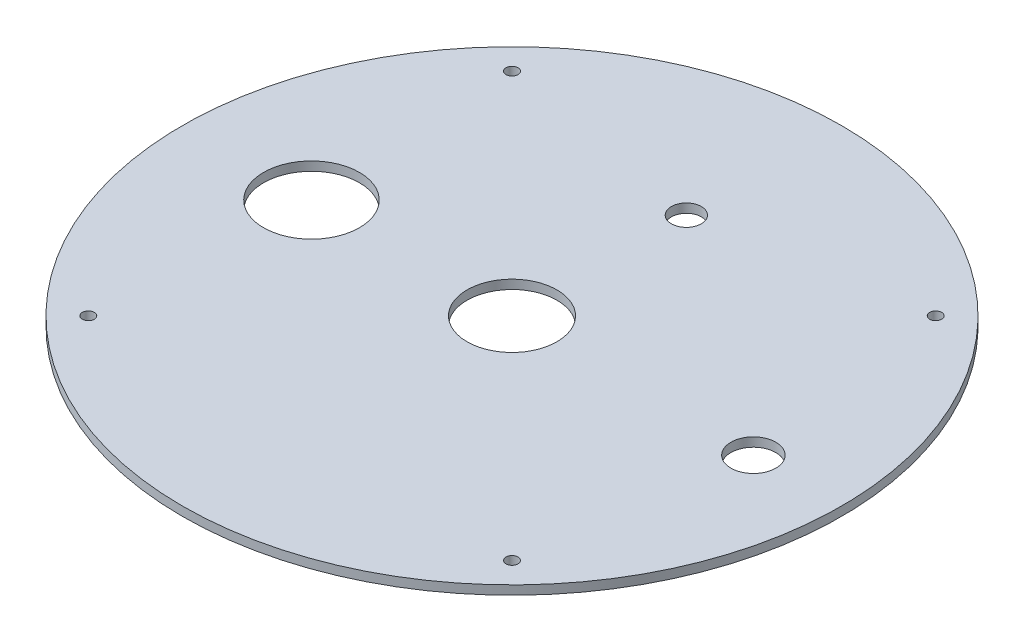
ISO-10303-21;
HEADER;
FILE_DESCRIPTION(('STEP AP214'),'2;1');
FILE_NAME('part.step','',(''),(''),'','','');
FILE_SCHEMA(('AUTOMOTIVE_DESIGN { 1 0 10303 214 1 1 1 1 }'));
ENDSEC;
DATA;
#1=APPLICATION_CONTEXT('core data for automotive mechanical design processes');
#2=APPLICATION_PROTOCOL_DEFINITION('international standard','automotive_design',2000,#1);
#3=PRODUCT_CONTEXT('',#1,'mechanical');
#4=PRODUCT('Part','Part','',(#3));
#5=PRODUCT_RELATED_PRODUCT_CATEGORY('part','',(#4));
#6=PRODUCT_DEFINITION_FORMATION('','',#4);
#7=PRODUCT_DEFINITION_CONTEXT('part definition',#1,'design');
#8=PRODUCT_DEFINITION('design','',#6,#7);
#9=PRODUCT_DEFINITION_SHAPE('','',#8);
#10=(LENGTH_UNIT() NAMED_UNIT(*) SI_UNIT(.MILLI.,.METRE.));
#11=(NAMED_UNIT(*) PLANE_ANGLE_UNIT() SI_UNIT($,.RADIAN.));
#12=(NAMED_UNIT(*) SI_UNIT($,.STERADIAN.) SOLID_ANGLE_UNIT());
#13=UNCERTAINTY_MEASURE_WITH_UNIT(LENGTH_MEASURE(1.E-05),#10,'distance_accuracy_value','');
#14=(GEOMETRIC_REPRESENTATION_CONTEXT(3) GLOBAL_UNCERTAINTY_ASSIGNED_CONTEXT((#13)) GLOBAL_UNIT_ASSIGNED_CONTEXT((#10,
#11,#12)) REPRESENTATION_CONTEXT('',''));
#15=CARTESIAN_POINT('',(0.,0.,0.));
#16=DIRECTION('',(0.,0.,1.));
#17=DIRECTION('',(1.,0.,0.));
#18=AXIS2_PLACEMENT_3D('',#15,#16,#17);
#19=CARTESIAN_POINT('',(0.,1.5,0.));
#20=DIRECTION('',(0.,-1.,0.));
#21=DIRECTION('',(0.,0.,-1.));
#22=AXIS2_PLACEMENT_3D('',#19,#20,#21);
#23=CYLINDRICAL_SURFACE('',#22,55.);
#24=CARTESIAN_POINT('',(0.,1.5,0.));
#25=DIRECTION('',(0.,1.,0.));
#26=DIRECTION('',(0.,0.,1.));
#27=AXIS2_PLACEMENT_3D('',#24,#25,#26);
#28=CIRCLE('',#27,55.);
#29=CARTESIAN_POINT('',(0.,1.5,55.));
#30=VERTEX_POINT('',#29);
#31=EDGE_CURVE('E10',#30,#30,#28,.T.);
#32=ORIENTED_EDGE('',*,*,#31,.F.);
#33=EDGE_LOOP('',(#32));
#34=FACE_BOUND('',#33,.T.);
#35=CARTESIAN_POINT('',(0.,0.,0.));
#36=DIRECTION('',(0.,1.,0.));
#37=DIRECTION('',(0.,0.,1.));
#38=AXIS2_PLACEMENT_3D('',#35,#36,#37);
#39=CIRCLE('',#38,55.);
#40=CARTESIAN_POINT('',(0.,0.,55.));
#41=VERTEX_POINT('',#40);
#42=EDGE_CURVE('E36',#41,#41,#39,.T.);
#43=ORIENTED_EDGE('',*,*,#42,.T.);
#44=EDGE_LOOP('',(#43));
#45=FACE_BOUND('',#44,.T.);
#46=ADVANCED_FACE('F33',(#34,#45),#23,.T.);
#47=CARTESIAN_POINT('',(0.,1.5,0.));
#48=DIRECTION('',(0.,1.,0.));
#49=DIRECTION('',(0.,0.,1.));
#50=AXIS2_PLACEMENT_3D('',#47,#48,#49);
#51=PLANE('',#50);
#52=CARTESIAN_POINT('',(40.286094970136,1.5,0.));
#53=DIRECTION('',(0.,-1.,0.));
#54=DIRECTION('',(0.,0.,-1.));
#55=AXIS2_PLACEMENT_3D('',#52,#53,#54);
#56=CIRCLE('',#55,3.75);
#57=CARTESIAN_POINT('',(40.286094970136,1.5,-3.75));
#58=VERTEX_POINT('',#57);
#59=EDGE_CURVE('E84',#58,#58,#56,.T.);
#60=ORIENTED_EDGE('',*,*,#59,.T.);
#61=EDGE_LOOP('',(#60));
#62=FACE_BOUND('',#61,.T.);
#63=CARTESIAN_POINT('',(0.,1.5,-29.0955130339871));
#64=DIRECTION('',(0.,-1.,0.));
#65=DIRECTION('',(0.,0.,-1.));
#66=AXIS2_PLACEMENT_3D('',#63,#64,#65);
#67=CIRCLE('',#66,2.5);
#68=CARTESIAN_POINT('',(0.,1.5,-31.5955130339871));
#69=VERTEX_POINT('',#68);
#70=EDGE_CURVE('E78',#69,#69,#67,.T.);
#71=ORIENTED_EDGE('',*,*,#70,.T.);
#72=EDGE_LOOP('',(#71));
#73=FACE_BOUND('',#72,.T.);
#74=CARTESIAN_POINT('',(-33.462326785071,1.5,0.));
#75=DIRECTION('',(0.,-1.,0.));
#76=DIRECTION('',(0.,0.,-1.));
#77=AXIS2_PLACEMENT_3D('',#74,#75,#76);
#78=CIRCLE('',#77,8.);
#79=CARTESIAN_POINT('',(-33.462326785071,1.5,-8.));
#80=VERTEX_POINT('',#79);
#81=EDGE_CURVE('E74',#80,#80,#78,.T.);
#82=ORIENTED_EDGE('',*,*,#81,.T.);
#83=EDGE_LOOP('',(#82));
#84=FACE_BOUND('',#83,.T.);
#85=CARTESIAN_POINT('',(0.,1.5,0.));
#86=DIRECTION('',(0.,1.,0.));
#87=DIRECTION('',(0.,0.,1.));
#88=AXIS2_PLACEMENT_3D('',#85,#86,#87);
#89=CIRCLE('',#88,7.5);
#90=CARTESIAN_POINT('',(0.,1.5,7.50000000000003));
#91=VERTEX_POINT('',#90);
#92=EDGE_CURVE('E71',#91,#91,#89,.T.);
#93=ORIENTED_EDGE('',*,*,#92,.F.);
#94=EDGE_LOOP('',(#93));
#95=FACE_BOUND('',#94,.T.);
#96=CARTESIAN_POINT('',(35.3553390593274,1.5,-35.3553390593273));
#97=DIRECTION('',(0.,1.,0.));
#98=DIRECTION('',(0.,0.,1.));
#99=AXIS2_PLACEMENT_3D('',#96,#97,#98);
#100=CIRCLE('',#99,0.999999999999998);
#101=CARTESIAN_POINT('',(35.3553390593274,1.5,-34.3553390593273));
#102=VERTEX_POINT('',#101);
#103=EDGE_CURVE('E65',#102,#102,#100,.T.);
#104=ORIENTED_EDGE('',*,*,#103,.F.);
#105=EDGE_LOOP('',(#104));
#106=FACE_BOUND('',#105,.T.);
#107=CARTESIAN_POINT('',(35.3553390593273,1.5,35.3553390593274));
#108=DIRECTION('',(0.,1.,0.));
#109=DIRECTION('',(0.,0.,1.));
#110=AXIS2_PLACEMENT_3D('',#107,#108,#109);
#111=CIRCLE('',#110,0.999999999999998);
#112=CARTESIAN_POINT('',(35.3553390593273,1.5,36.3553390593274));
#113=VERTEX_POINT('',#112);
#114=EDGE_CURVE('E59',#113,#113,#111,.T.);
#115=ORIENTED_EDGE('',*,*,#114,.F.);
#116=EDGE_LOOP('',(#115));
#117=FACE_BOUND('',#116,.T.);
#118=CARTESIAN_POINT('',(-35.3553390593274,1.5,35.3553390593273));
#119=DIRECTION('',(0.,1.,0.));
#120=DIRECTION('',(0.,0.,1.));
#121=AXIS2_PLACEMENT_3D('',#118,#119,#120);
#122=CIRCLE('',#121,0.999999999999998);
#123=CARTESIAN_POINT('',(-35.3553390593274,1.5,36.3553390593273));
#124=VERTEX_POINT('',#123);
#125=EDGE_CURVE('E53',#124,#124,#122,.T.);
#126=ORIENTED_EDGE('',*,*,#125,.F.);
#127=EDGE_LOOP('',(#126));
#128=FACE_BOUND('',#127,.T.);
#129=CARTESIAN_POINT('',(-35.3553390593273,1.5,-35.3553390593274));
#130=DIRECTION('',(0.,1.,0.));
#131=DIRECTION('',(0.,0.,1.));
#132=AXIS2_PLACEMENT_3D('',#129,#130,#131);
#133=CIRCLE('',#132,0.999999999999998);
#134=CARTESIAN_POINT('',(-35.3553390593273,1.5,-34.3553390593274));
#135=VERTEX_POINT('',#134);
#136=EDGE_CURVE('E47',#135,#135,#133,.T.);
#137=ORIENTED_EDGE('',*,*,#136,.F.);
#138=EDGE_LOOP('',(#137));
#139=FACE_BOUND('',#138,.T.);
#140=ORIENTED_EDGE('',*,*,#31,.T.);
#141=EDGE_LOOP('',(#140));
#142=FACE_BOUND('',#141,.T.);
#143=ADVANCED_FACE('F93',(#62,#73,#84,#95,#106,#117,#128,#139,#142),#51,.T.);
#144=CARTESIAN_POINT('',(0.,0.,0.));
#145=DIRECTION('',(0.,1.,0.));
#146=DIRECTION('',(0.,0.,1.));
#147=AXIS2_PLACEMENT_3D('',#144,#145,#146);
#148=PLANE('',#147);
#149=CARTESIAN_POINT('',(40.286094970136,0.,0.));
#150=DIRECTION('',(0.,-1.,0.));
#151=DIRECTION('',(0.,0.,-1.));
#152=AXIS2_PLACEMENT_3D('',#149,#150,#151);
#153=CIRCLE('',#152,3.75);
#154=CARTESIAN_POINT('',(40.286094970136,0.,-3.75));
#155=VERTEX_POINT('',#154);
#156=EDGE_CURVE('E87',#155,#155,#153,.T.);
#157=ORIENTED_EDGE('',*,*,#156,.F.);
#158=EDGE_LOOP('',(#157));
#159=FACE_BOUND('',#158,.T.);
#160=CARTESIAN_POINT('',(0.,0.,-29.0955130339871));
#161=DIRECTION('',(0.,-1.,0.));
#162=DIRECTION('',(0.,0.,-1.));
#163=AXIS2_PLACEMENT_3D('',#160,#161,#162);
#164=CIRCLE('',#163,2.5);
#165=CARTESIAN_POINT('',(0.,0.,-31.5955130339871));
#166=VERTEX_POINT('',#165);
#167=EDGE_CURVE('E81',#166,#166,#164,.T.);
#168=ORIENTED_EDGE('',*,*,#167,.F.);
#169=EDGE_LOOP('',(#168));
#170=FACE_BOUND('',#169,.T.);
#171=CARTESIAN_POINT('',(-33.462326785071,0.,0.));
#172=DIRECTION('',(0.,-1.,0.));
#173=DIRECTION('',(0.,0.,-1.));
#174=AXIS2_PLACEMENT_3D('',#171,#172,#173);
#175=CIRCLE('',#174,8.);
#176=CARTESIAN_POINT('',(-33.462326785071,0.,-8.));
#177=VERTEX_POINT('',#176);
#178=EDGE_CURVE('E75',#177,#177,#175,.T.);
#179=ORIENTED_EDGE('',*,*,#178,.F.);
#180=EDGE_LOOP('',(#179));
#181=FACE_BOUND('',#180,.T.);
#182=CARTESIAN_POINT('',(0.,0.,0.));
#183=DIRECTION('',(0.,1.,0.));
#184=DIRECTION('',(0.,0.,1.));
#185=AXIS2_PLACEMENT_3D('',#182,#183,#184);
#186=CIRCLE('',#185,7.5);
#187=CARTESIAN_POINT('',(0.,0.,7.50000000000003));
#188=VERTEX_POINT('',#187);
#189=EDGE_CURVE('E68',#188,#188,#186,.F.);
#190=ORIENTED_EDGE('',*,*,#189,.F.);
#191=EDGE_LOOP('',(#190));
#192=FACE_BOUND('',#191,.T.);
#193=CARTESIAN_POINT('',(35.3553390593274,0.,-35.3553390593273));
#194=DIRECTION('',(0.,1.,0.));
#195=DIRECTION('',(0.,0.,1.));
#196=AXIS2_PLACEMENT_3D('',#193,#194,#195);
#197=CIRCLE('',#196,0.999999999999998);
#198=CARTESIAN_POINT('',(35.3553390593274,0.,-34.3553390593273));
#199=VERTEX_POINT('',#198);
#200=EDGE_CURVE('E62',#199,#199,#197,.F.);
#201=ORIENTED_EDGE('',*,*,#200,.F.);
#202=EDGE_LOOP('',(#201));
#203=FACE_BOUND('',#202,.T.);
#204=CARTESIAN_POINT('',(35.3553390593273,0.,35.3553390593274));
#205=DIRECTION('',(0.,1.,0.));
#206=DIRECTION('',(0.,0.,1.));
#207=AXIS2_PLACEMENT_3D('',#204,#205,#206);
#208=CIRCLE('',#207,0.999999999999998);
#209=CARTESIAN_POINT('',(35.3553390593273,0.,36.3553390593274));
#210=VERTEX_POINT('',#209);
#211=EDGE_CURVE('E56',#210,#210,#208,.F.);
#212=ORIENTED_EDGE('',*,*,#211,.F.);
#213=EDGE_LOOP('',(#212));
#214=FACE_BOUND('',#213,.T.);
#215=CARTESIAN_POINT('',(-35.3553390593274,0.,35.3553390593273));
#216=DIRECTION('',(0.,1.,0.));
#217=DIRECTION('',(0.,0.,1.));
#218=AXIS2_PLACEMENT_3D('',#215,#216,#217);
#219=CIRCLE('',#218,0.999999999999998);
#220=CARTESIAN_POINT('',(-35.3553390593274,0.,36.3553390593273));
#221=VERTEX_POINT('',#220);
#222=EDGE_CURVE('E50',#221,#221,#219,.F.);
#223=ORIENTED_EDGE('',*,*,#222,.F.);
#224=EDGE_LOOP('',(#223));
#225=FACE_BOUND('',#224,.T.);
#226=CARTESIAN_POINT('',(-35.3553390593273,0.,-35.3553390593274));
#227=DIRECTION('',(0.,1.,0.));
#228=DIRECTION('',(0.,0.,1.));
#229=AXIS2_PLACEMENT_3D('',#226,#227,#228);
#230=CIRCLE('',#229,0.999999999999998);
#231=CARTESIAN_POINT('',(-35.3553390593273,0.,-34.3553390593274));
#232=VERTEX_POINT('',#231);
#233=EDGE_CURVE('E43',#232,#232,#230,.F.);
#234=ORIENTED_EDGE('',*,*,#233,.F.);
#235=EDGE_LOOP('',(#234));
#236=FACE_BOUND('',#235,.T.);
#237=ORIENTED_EDGE('',*,*,#42,.F.);
#238=EDGE_LOOP('',(#237));
#239=FACE_BOUND('',#238,.T.);
#240=ADVANCED_FACE('F103',(#159,#170,#181,#192,#203,#214,#225,#236,#239),#148,.F.);
#241=CARTESIAN_POINT('',(-35.3553390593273,-21.2132034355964,-35.3553390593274));
#242=DIRECTION('',(0.,1.,0.));
#243=DIRECTION('',(0.,0.,1.));
#244=AXIS2_PLACEMENT_3D('',#241,#242,#243);
#245=CYLINDRICAL_SURFACE('',#244,0.999999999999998);
#246=ORIENTED_EDGE('',*,*,#233,.T.);
#247=EDGE_LOOP('',(#246));
#248=FACE_BOUND('',#247,.T.);
#249=ORIENTED_EDGE('',*,*,#136,.T.);
#250=EDGE_LOOP('',(#249));
#251=FACE_BOUND('',#250,.T.);
#252=ADVANCED_FACE('F106',(#248,#251),#245,.F.);
#253=CARTESIAN_POINT('',(-35.3553390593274,-21.2132034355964,35.3553390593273));
#254=DIRECTION('',(0.,1.,0.));
#255=DIRECTION('',(0.,0.,1.));
#256=AXIS2_PLACEMENT_3D('',#253,#254,#255);
#257=CYLINDRICAL_SURFACE('',#256,0.999999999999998);
#258=ORIENTED_EDGE('',*,*,#222,.T.);
#259=EDGE_LOOP('',(#258));
#260=FACE_BOUND('',#259,.T.);
#261=ORIENTED_EDGE('',*,*,#125,.T.);
#262=EDGE_LOOP('',(#261));
#263=FACE_BOUND('',#262,.T.);
#264=ADVANCED_FACE('F134',(#260,#263),#257,.F.);
#265=CARTESIAN_POINT('',(35.3553390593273,-21.2132034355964,35.3553390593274));
#266=DIRECTION('',(0.,1.,0.));
#267=DIRECTION('',(0.,0.,1.));
#268=AXIS2_PLACEMENT_3D('',#265,#266,#267);
#269=CYLINDRICAL_SURFACE('',#268,0.999999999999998);
#270=ORIENTED_EDGE('',*,*,#211,.T.);
#271=EDGE_LOOP('',(#270));
#272=FACE_BOUND('',#271,.T.);
#273=ORIENTED_EDGE('',*,*,#114,.T.);
#274=EDGE_LOOP('',(#273));
#275=FACE_BOUND('',#274,.T.);
#276=ADVANCED_FACE('F138',(#272,#275),#269,.F.);
#277=CARTESIAN_POINT('',(35.3553390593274,-21.2132034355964,-35.3553390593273));
#278=DIRECTION('',(0.,1.,0.));
#279=DIRECTION('',(0.,0.,1.));
#280=AXIS2_PLACEMENT_3D('',#277,#278,#279);
#281=CYLINDRICAL_SURFACE('',#280,0.999999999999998);
#282=ORIENTED_EDGE('',*,*,#200,.T.);
#283=EDGE_LOOP('',(#282));
#284=FACE_BOUND('',#283,.T.);
#285=ORIENTED_EDGE('',*,*,#103,.T.);
#286=EDGE_LOOP('',(#285));
#287=FACE_BOUND('',#286,.T.);
#288=ADVANCED_FACE('F142',(#284,#287),#281,.F.);
#289=CARTESIAN_POINT('',(0.,-21.2132034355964,0.));
#290=DIRECTION('',(0.,1.,0.));
#291=DIRECTION('',(0.,0.,1.));
#292=AXIS2_PLACEMENT_3D('',#289,#290,#291);
#293=CYLINDRICAL_SURFACE('',#292,7.5);
#294=ORIENTED_EDGE('',*,*,#189,.T.);
#295=EDGE_LOOP('',(#294));
#296=FACE_BOUND('',#295,.T.);
#297=ORIENTED_EDGE('',*,*,#92,.T.);
#298=EDGE_LOOP('',(#297));
#299=FACE_BOUND('',#298,.T.);
#300=ADVANCED_FACE('F146',(#296,#299),#293,.F.);
#301=CARTESIAN_POINT('',(-33.462326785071,1.5,0.));
#302=DIRECTION('',(0.,-1.,0.));
#303=DIRECTION('',(0.,0.,-1.));
#304=AXIS2_PLACEMENT_3D('',#301,#302,#303);
#305=CYLINDRICAL_SURFACE('',#304,8.);
#306=ORIENTED_EDGE('',*,*,#81,.F.);
#307=EDGE_LOOP('',(#306));
#308=FACE_BOUND('',#307,.T.);
#309=ORIENTED_EDGE('',*,*,#178,.T.);
#310=EDGE_LOOP('',(#309));
#311=FACE_BOUND('',#310,.T.);
#312=ADVANCED_FACE('F150',(#308,#311),#305,.F.);
#313=CARTESIAN_POINT('',(0.,1.5,-29.0955130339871));
#314=DIRECTION('',(0.,-1.,0.));
#315=DIRECTION('',(0.,0.,-1.));
#316=AXIS2_PLACEMENT_3D('',#313,#314,#315);
#317=CYLINDRICAL_SURFACE('',#316,2.5);
#318=ORIENTED_EDGE('',*,*,#70,.F.);
#319=EDGE_LOOP('',(#318));
#320=FACE_BOUND('',#319,.T.);
#321=ORIENTED_EDGE('',*,*,#167,.T.);
#322=EDGE_LOOP('',(#321));
#323=FACE_BOUND('',#322,.T.);
#324=ADVANCED_FACE('F99',(#320,#323),#317,.F.);
#325=CARTESIAN_POINT('',(40.286094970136,1.5,0.));
#326=DIRECTION('',(0.,-1.,0.));
#327=DIRECTION('',(0.,0.,-1.));
#328=AXIS2_PLACEMENT_3D('',#325,#326,#327);
#329=CYLINDRICAL_SURFACE('',#328,3.75);
#330=ORIENTED_EDGE('',*,*,#59,.F.);
#331=EDGE_LOOP('',(#330));
#332=FACE_BOUND('',#331,.T.);
#333=ORIENTED_EDGE('',*,*,#156,.T.);
#334=EDGE_LOOP('',(#333));
#335=FACE_BOUND('',#334,.T.);
#336=ADVANCED_FACE('F96',(#332,#335),#329,.F.);
#337=CLOSED_SHELL('',(#46,#143,#240,#252,#264,#276,#288,#300,#312,#324,#336));
#338=MANIFOLD_SOLID_BREP('B2',#337);
#339=ADVANCED_BREP_SHAPE_REPRESENTATION('',(#18,#338),#14);
#340=SHAPE_DEFINITION_REPRESENTATION(#9,#339);
ENDSEC;
END-ISO-10303-21;
